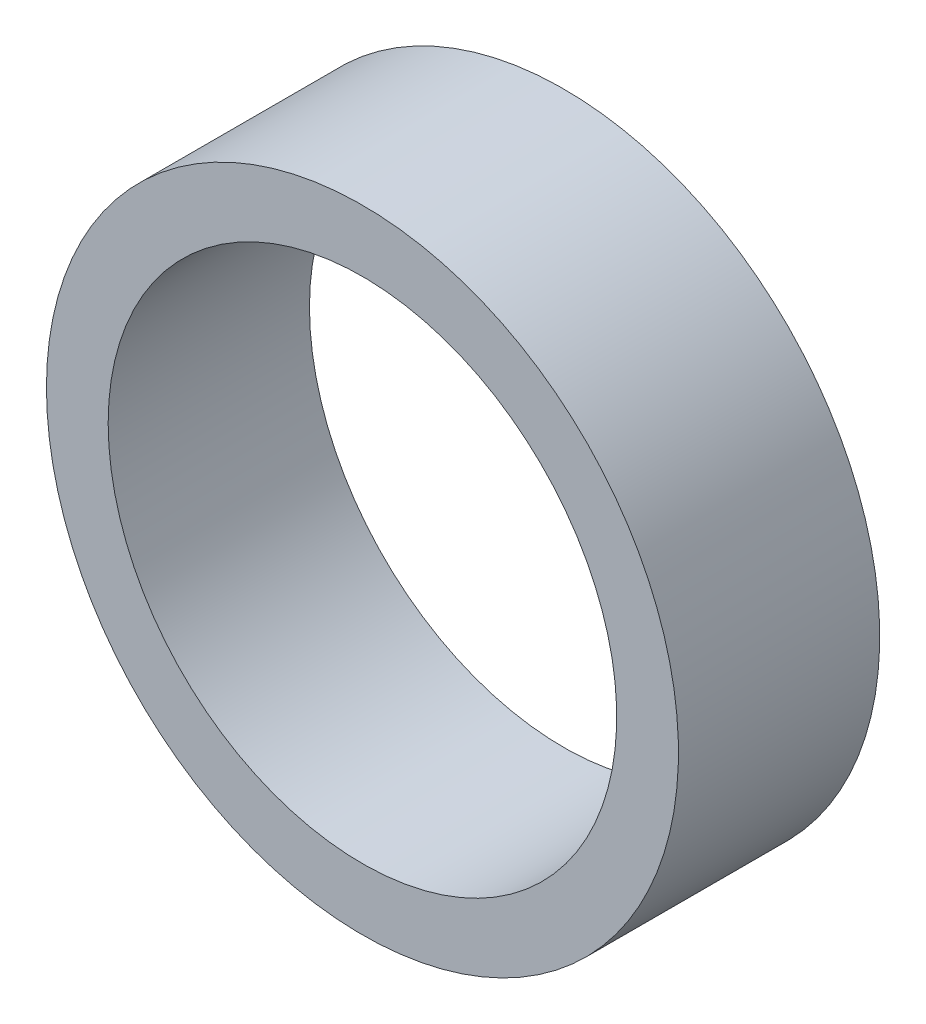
ISO-10303-21;
HEADER;
FILE_DESCRIPTION(('STEP AP214'),'2;1');
FILE_NAME('part.step','',(''),(''),'','','');
FILE_SCHEMA(('AUTOMOTIVE_DESIGN { 1 0 10303 214 1 1 1 1 }'));
ENDSEC;
DATA;
#1=APPLICATION_CONTEXT('core data for automotive mechanical design processes');
#2=APPLICATION_PROTOCOL_DEFINITION('international standard','automotive_design',2000,#1);
#3=PRODUCT_CONTEXT('',#1,'mechanical');
#4=PRODUCT('Part','Part','',(#3));
#5=PRODUCT_RELATED_PRODUCT_CATEGORY('part','',(#4));
#6=PRODUCT_DEFINITION_FORMATION('','',#4);
#7=PRODUCT_DEFINITION_CONTEXT('part definition',#1,'design');
#8=PRODUCT_DEFINITION('design','',#6,#7);
#9=PRODUCT_DEFINITION_SHAPE('','',#8);
#10=(LENGTH_UNIT() NAMED_UNIT(*) SI_UNIT(.MILLI.,.METRE.));
#11=(NAMED_UNIT(*) PLANE_ANGLE_UNIT() SI_UNIT($,.RADIAN.));
#12=(NAMED_UNIT(*) SI_UNIT($,.STERADIAN.) SOLID_ANGLE_UNIT());
#13=UNCERTAINTY_MEASURE_WITH_UNIT(LENGTH_MEASURE(1.E-05),#10,'distance_accuracy_value','');
#14=(GEOMETRIC_REPRESENTATION_CONTEXT(3) GLOBAL_UNCERTAINTY_ASSIGNED_CONTEXT((#13)) GLOBAL_UNIT_ASSIGNED_CONTEXT((#10,
#11,#12)) REPRESENTATION_CONTEXT('',''));
#15=CARTESIAN_POINT('',(0.,0.,0.));
#16=DIRECTION('',(0.,0.,1.));
#17=DIRECTION('',(1.,0.,0.));
#18=AXIS2_PLACEMENT_3D('',#15,#16,#17);
#19=CARTESIAN_POINT('',(0.,0.,1.905));
#20=DIRECTION('',(0.,0.,1.));
#21=DIRECTION('',(1.,0.,0.));
#22=AXIS2_PLACEMENT_3D('',#19,#20,#21);
#23=PLANE('',#22);
#24=CARTESIAN_POINT('',(0.,0.,1.905));
#25=DIRECTION('',(0.,0.,1.));
#26=DIRECTION('',(1.,0.,0.));
#27=AXIS2_PLACEMENT_3D('',#24,#25,#26);
#28=CIRCLE('',#27,5.9817);
#29=CARTESIAN_POINT('',(-5.9817,0.,1.905));
#30=VERTEX_POINT('',#29);
#31=EDGE_CURVE('E10',#30,#30,#28,.T.);
#32=ORIENTED_EDGE('',*,*,#31,.T.);
#33=EDGE_LOOP('',(#32));
#34=FACE_BOUND('',#33,.T.);
#35=CARTESIAN_POINT('',(0.,0.,1.905));
#36=DIRECTION('',(0.,0.,1.));
#37=DIRECTION('',(1.,0.,0.));
#38=AXIS2_PLACEMENT_3D('',#35,#36,#37);
#39=CIRCLE('',#38,4.8133);
#40=CARTESIAN_POINT('',(-4.8133,0.,1.905));
#41=VERTEX_POINT('',#40);
#42=EDGE_CURVE('E42',#41,#41,#39,.T.);
#43=ORIENTED_EDGE('',*,*,#42,.F.);
#44=EDGE_LOOP('',(#43));
#45=FACE_BOUND('',#44,.T.);
#46=ADVANCED_FACE('F31',(#34,#45),#23,.T.);
#47=CARTESIAN_POINT('',(0.,0.,-1.905));
#48=DIRECTION('',(0.,0.,1.));
#49=DIRECTION('',(1.,0.,0.));
#50=AXIS2_PLACEMENT_3D('',#47,#48,#49);
#51=PLANE('',#50);
#52=CARTESIAN_POINT('',(0.,0.,-1.905));
#53=DIRECTION('',(0.,0.,1.));
#54=DIRECTION('',(1.,0.,0.));
#55=AXIS2_PLACEMENT_3D('',#52,#53,#54);
#56=CIRCLE('',#55,5.9817);
#57=CARTESIAN_POINT('',(-5.9817,0.,-1.905));
#58=VERTEX_POINT('',#57);
#59=EDGE_CURVE('E35',#58,#58,#56,.T.);
#60=ORIENTED_EDGE('',*,*,#59,.F.);
#61=EDGE_LOOP('',(#60));
#62=FACE_BOUND('',#61,.T.);
#63=CARTESIAN_POINT('',(0.,0.,-1.905));
#64=DIRECTION('',(0.,0.,1.));
#65=DIRECTION('',(1.,0.,0.));
#66=AXIS2_PLACEMENT_3D('',#63,#64,#65);
#67=CIRCLE('',#66,4.8133);
#68=CARTESIAN_POINT('',(-4.8133,0.,-1.905));
#69=VERTEX_POINT('',#68);
#70=EDGE_CURVE('E44',#69,#69,#67,.T.);
#71=ORIENTED_EDGE('',*,*,#70,.T.);
#72=EDGE_LOOP('',(#71));
#73=FACE_BOUND('',#72,.T.);
#74=ADVANCED_FACE('F54',(#62,#73),#51,.F.);
#75=CARTESIAN_POINT('',(0.,0.,1.905));
#76=DIRECTION('',(0.,0.,-1.));
#77=DIRECTION('',(-1.,0.,0.));
#78=AXIS2_PLACEMENT_3D('',#75,#76,#77);
#79=CYLINDRICAL_SURFACE('',#78,5.9817);
#80=CARTESIAN_POINT('',(-5.9817,0.,1.905));
#81=CARTESIAN_POINT('',(-5.9817,0.,1.8653125));
#82=CARTESIAN_POINT('',(-5.9817,0.,1.825625));
#83=CARTESIAN_POINT('',(-5.9817,0.,1.74625));
#84=CARTESIAN_POINT('',(-5.9817,0.,1.7065625));
#85=CARTESIAN_POINT('',(-5.9817,0.,1.6271875));
#86=CARTESIAN_POINT('',(-5.9817,0.,1.5875));
#87=CARTESIAN_POINT('',(-5.9817,0.,1.508125));
#88=CARTESIAN_POINT('',(-5.9817,0.,1.4684375));
#89=CARTESIAN_POINT('',(-5.9817,0.,1.3890625));
#90=CARTESIAN_POINT('',(-5.9817,0.,1.349375));
#91=CARTESIAN_POINT('',(-5.9817,0.,1.27));
#92=CARTESIAN_POINT('',(-5.9817,0.,1.2303125));
#93=CARTESIAN_POINT('',(-5.9817,0.,1.1509375));
#94=CARTESIAN_POINT('',(-5.9817,0.,1.11125));
#95=CARTESIAN_POINT('',(-5.9817,0.,1.031875));
#96=CARTESIAN_POINT('',(-5.9817,0.,0.9921875));
#97=CARTESIAN_POINT('',(-5.9817,0.,0.9128125));
#98=CARTESIAN_POINT('',(-5.9817,0.,0.873125));
#99=CARTESIAN_POINT('',(-5.9817,0.,0.79375));
#100=CARTESIAN_POINT('',(-5.9817,0.,0.7540625));
#101=CARTESIAN_POINT('',(-5.9817,0.,0.6746875));
#102=CARTESIAN_POINT('',(-5.9817,0.,0.635));
#103=CARTESIAN_POINT('',(-5.9817,0.,0.555625));
#104=CARTESIAN_POINT('',(-5.9817,0.,0.5159375));
#105=CARTESIAN_POINT('',(-5.9817,0.,0.4365625));
#106=CARTESIAN_POINT('',(-5.9817,0.,0.396875));
#107=CARTESIAN_POINT('',(-5.9817,0.,0.3175));
#108=CARTESIAN_POINT('',(-5.9817,0.,0.2778125));
#109=CARTESIAN_POINT('',(-5.9817,0.,0.1984375));
#110=CARTESIAN_POINT('',(-5.9817,0.,0.15875));
#111=CARTESIAN_POINT('',(-5.9817,0.,0.0793749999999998));
#112=CARTESIAN_POINT('',(-5.9817,0.,0.0396874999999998));
#113=CARTESIAN_POINT('',(-5.9817,0.,-0.0396875));
#114=CARTESIAN_POINT('',(-5.9817,0.,-0.0793749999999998));
#115=CARTESIAN_POINT('',(-5.9817,0.,-0.15875));
#116=CARTESIAN_POINT('',(-5.9817,0.,-0.1984375));
#117=CARTESIAN_POINT('',(-5.9817,0.,-0.2778125));
#118=CARTESIAN_POINT('',(-5.9817,0.,-0.3175));
#119=CARTESIAN_POINT('',(-5.9817,0.,-0.396875));
#120=CARTESIAN_POINT('',(-5.9817,0.,-0.4365625));
#121=CARTESIAN_POINT('',(-5.9817,0.,-0.5159375));
#122=CARTESIAN_POINT('',(-5.9817,0.,-0.555625));
#123=CARTESIAN_POINT('',(-5.9817,0.,-0.635));
#124=CARTESIAN_POINT('',(-5.9817,0.,-0.6746875));
#125=CARTESIAN_POINT('',(-5.9817,0.,-0.7540625));
#126=CARTESIAN_POINT('',(-5.9817,0.,-0.79375));
#127=CARTESIAN_POINT('',(-5.9817,0.,-0.873125));
#128=CARTESIAN_POINT('',(-5.9817,0.,-0.9128125));
#129=CARTESIAN_POINT('',(-5.9817,0.,-0.9921875));
#130=CARTESIAN_POINT('',(-5.9817,0.,-1.031875));
#131=CARTESIAN_POINT('',(-5.9817,0.,-1.11125));
#132=CARTESIAN_POINT('',(-5.9817,0.,-1.1509375));
#133=CARTESIAN_POINT('',(-5.9817,0.,-1.2303125));
#134=CARTESIAN_POINT('',(-5.9817,0.,-1.27));
#135=CARTESIAN_POINT('',(-5.9817,0.,-1.349375));
#136=CARTESIAN_POINT('',(-5.9817,0.,-1.3890625));
#137=CARTESIAN_POINT('',(-5.9817,0.,-1.4684375));
#138=CARTESIAN_POINT('',(-5.9817,0.,-1.508125));
#139=CARTESIAN_POINT('',(-5.9817,0.,-1.5875));
#140=CARTESIAN_POINT('',(-5.9817,0.,-1.6271875));
#141=CARTESIAN_POINT('',(-5.9817,0.,-1.7065625));
#142=CARTESIAN_POINT('',(-5.9817,0.,-1.74625));
#143=CARTESIAN_POINT('',(-5.9817,0.,-1.825625));
#144=CARTESIAN_POINT('',(-5.9817,0.,-1.8653125));
#145=CARTESIAN_POINT('',(-5.9817,0.,-1.905));
#146=B_SPLINE_CURVE_WITH_KNOTS('',3,(#80,#81,#82,#83,#84,#85,#86,#87,#88,#89,#90,#91,#92,#93,
#94,#95,#96,#97,#98,#99,#100,#101,#102,#103,#104,#105,#106,#107,#108,#109,#110,#111,#112,#113,
#114,#115,#116,#117,#118,#119,#120,#121,#122,#123,#124,#125,#126,#127,#128,#129,#130,#131,#132,
#133,#134,#135,#136,#137,#138,#139,#140,#141,#142,#143,#144,#145),.UNSPECIFIED.,.F.,.F.,(4,2,2,
2,2,2,2,2,2,2,2,2,2,2,2,2,2,2,2,2,2,2,2,2,2,2,2,2,2,2,2,2,4),(0.,0.1190625,0.238125,0.3571875,
0.47625,0.5953125,0.714375,0.8334375,0.9525,1.0715625,1.190625,1.3096875,1.42875,1.5478125,
1.666875,1.7859375,1.905,2.0240625,2.143125,2.2621875,2.38125,2.5003125,2.619375,2.7384375,
2.8575,2.9765625,3.095625,3.2146875,3.33375,3.4528125,3.571875,3.6909375,3.81),.UNSPECIFIED.);
#147=EDGE_CURVE('BSEAM33',#30,#58,#146,.T.);
#148=ORIENTED_EDGE('',*,*,#31,.F.);
#149=ORIENTED_EDGE('',*,*,#59,.T.);
#150=ORIENTED_EDGE('',*,*,#147,.T.);
#151=ORIENTED_EDGE('',*,*,#147,.F.);
#152=EDGE_LOOP('',(#148,#150,#149,#151));
#153=FACE_BOUND('',#152,.T.);
#154=ADVANCED_FACE('F33',(#153),#79,.T.);
#155=CARTESIAN_POINT('',(0.,0.,1.905));
#156=DIRECTION('',(0.,0.,-1.));
#157=DIRECTION('',(-1.,0.,0.));
#158=AXIS2_PLACEMENT_3D('',#155,#156,#157);
#159=CYLINDRICAL_SURFACE('',#158,4.8133);
#160=CARTESIAN_POINT('',(-4.8133,0.,1.905));
#161=CARTESIAN_POINT('',(-4.8133,0.,1.8653125));
#162=CARTESIAN_POINT('',(-4.8133,0.,1.825625));
#163=CARTESIAN_POINT('',(-4.8133,0.,1.74625));
#164=CARTESIAN_POINT('',(-4.8133,0.,1.7065625));
#165=CARTESIAN_POINT('',(-4.8133,0.,1.6271875));
#166=CARTESIAN_POINT('',(-4.8133,0.,1.5875));
#167=CARTESIAN_POINT('',(-4.8133,0.,1.508125));
#168=CARTESIAN_POINT('',(-4.8133,0.,1.4684375));
#169=CARTESIAN_POINT('',(-4.8133,0.,1.3890625));
#170=CARTESIAN_POINT('',(-4.8133,0.,1.349375));
#171=CARTESIAN_POINT('',(-4.8133,0.,1.27));
#172=CARTESIAN_POINT('',(-4.8133,0.,1.2303125));
#173=CARTESIAN_POINT('',(-4.8133,0.,1.1509375));
#174=CARTESIAN_POINT('',(-4.8133,0.,1.11125));
#175=CARTESIAN_POINT('',(-4.8133,0.,1.031875));
#176=CARTESIAN_POINT('',(-4.8133,0.,0.9921875));
#177=CARTESIAN_POINT('',(-4.8133,0.,0.9128125));
#178=CARTESIAN_POINT('',(-4.8133,0.,0.873125));
#179=CARTESIAN_POINT('',(-4.8133,0.,0.79375));
#180=CARTESIAN_POINT('',(-4.8133,0.,0.7540625));
#181=CARTESIAN_POINT('',(-4.8133,0.,0.6746875));
#182=CARTESIAN_POINT('',(-4.8133,0.,0.635));
#183=CARTESIAN_POINT('',(-4.8133,0.,0.555625));
#184=CARTESIAN_POINT('',(-4.8133,0.,0.5159375));
#185=CARTESIAN_POINT('',(-4.8133,0.,0.4365625));
#186=CARTESIAN_POINT('',(-4.8133,0.,0.396875));
#187=CARTESIAN_POINT('',(-4.8133,0.,0.3175));
#188=CARTESIAN_POINT('',(-4.8133,0.,0.2778125));
#189=CARTESIAN_POINT('',(-4.8133,0.,0.1984375));
#190=CARTESIAN_POINT('',(-4.8133,0.,0.15875));
#191=CARTESIAN_POINT('',(-4.8133,0.,0.0793749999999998));
#192=CARTESIAN_POINT('',(-4.8133,0.,0.0396874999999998));
#193=CARTESIAN_POINT('',(-4.8133,0.,-0.0396875));
#194=CARTESIAN_POINT('',(-4.8133,0.,-0.0793749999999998));
#195=CARTESIAN_POINT('',(-4.8133,0.,-0.15875));
#196=CARTESIAN_POINT('',(-4.8133,0.,-0.1984375));
#197=CARTESIAN_POINT('',(-4.8133,0.,-0.2778125));
#198=CARTESIAN_POINT('',(-4.8133,0.,-0.3175));
#199=CARTESIAN_POINT('',(-4.8133,0.,-0.396875));
#200=CARTESIAN_POINT('',(-4.8133,0.,-0.4365625));
#201=CARTESIAN_POINT('',(-4.8133,0.,-0.5159375));
#202=CARTESIAN_POINT('',(-4.8133,0.,-0.555625));
#203=CARTESIAN_POINT('',(-4.8133,0.,-0.635));
#204=CARTESIAN_POINT('',(-4.8133,0.,-0.6746875));
#205=CARTESIAN_POINT('',(-4.8133,0.,-0.7540625));
#206=CARTESIAN_POINT('',(-4.8133,0.,-0.79375));
#207=CARTESIAN_POINT('',(-4.8133,0.,-0.873125));
#208=CARTESIAN_POINT('',(-4.8133,0.,-0.9128125));
#209=CARTESIAN_POINT('',(-4.8133,0.,-0.9921875));
#210=CARTESIAN_POINT('',(-4.8133,0.,-1.031875));
#211=CARTESIAN_POINT('',(-4.8133,0.,-1.11125));
#212=CARTESIAN_POINT('',(-4.8133,0.,-1.1509375));
#213=CARTESIAN_POINT('',(-4.8133,0.,-1.2303125));
#214=CARTESIAN_POINT('',(-4.8133,0.,-1.27));
#215=CARTESIAN_POINT('',(-4.8133,0.,-1.349375));
#216=CARTESIAN_POINT('',(-4.8133,0.,-1.3890625));
#217=CARTESIAN_POINT('',(-4.8133,0.,-1.4684375));
#218=CARTESIAN_POINT('',(-4.8133,0.,-1.508125));
#219=CARTESIAN_POINT('',(-4.8133,0.,-1.5875));
#220=CARTESIAN_POINT('',(-4.8133,0.,-1.6271875));
#221=CARTESIAN_POINT('',(-4.8133,0.,-1.7065625));
#222=CARTESIAN_POINT('',(-4.8133,0.,-1.74625));
#223=CARTESIAN_POINT('',(-4.8133,0.,-1.825625));
#224=CARTESIAN_POINT('',(-4.8133,0.,-1.8653125));
#225=CARTESIAN_POINT('',(-4.8133,0.,-1.905));
#226=B_SPLINE_CURVE_WITH_KNOTS('',3,(#160,#161,#162,#163,#164,#165,#166,#167,#168,#169,#170,
#171,#172,#173,#174,#175,#176,#177,#178,#179,#180,#181,#182,#183,#184,#185,#186,#187,#188,#189,
#190,#191,#192,#193,#194,#195,#196,#197,#198,#199,#200,#201,#202,#203,#204,#205,#206,#207,#208,
#209,#210,#211,#212,#213,#214,#215,#216,#217,#218,#219,#220,#221,#222,#223,#224,#225),
.UNSPECIFIED.,.F.,.F.,(4,2,2,2,2,2,2,2,2,2,2,2,2,2,2,2,2,2,2,2,2,2,2,2,2,2,2,2,2,2,2,2,4),(0.,
0.1190625,0.238125,0.3571875,0.47625,0.5953125,0.714375,0.8334375,0.9525,1.0715625,1.190625,
1.3096875,1.42875,1.5478125,1.666875,1.7859375,1.905,2.0240625,2.143125,2.2621875,2.38125,
2.5003125,2.619375,2.7384375,2.8575,2.9765625,3.095625,3.2146875,3.33375,3.4528125,3.571875,
3.6909375,3.81),.UNSPECIFIED.);
#227=EDGE_CURVE('BSEAM50',#41,#69,#226,.T.);
#228=ORIENTED_EDGE('',*,*,#42,.T.);
#229=ORIENTED_EDGE('',*,*,#70,.F.);
#230=ORIENTED_EDGE('',*,*,#227,.T.);
#231=ORIENTED_EDGE('',*,*,#227,.F.);
#232=EDGE_LOOP('',(#228,#230,#229,#231));
#233=FACE_BOUND('',#232,.T.);
#234=ADVANCED_FACE('F50',(#233),#159,.F.);
#235=CLOSED_SHELL('',(#46,#74,#154,#234));
#236=MANIFOLD_SOLID_BREP('B2',#235);
#237=ADVANCED_BREP_SHAPE_REPRESENTATION('',(#18,#236),#14);
#238=SHAPE_DEFINITION_REPRESENTATION(#9,#237);
ENDSEC;
END-ISO-10303-21;
